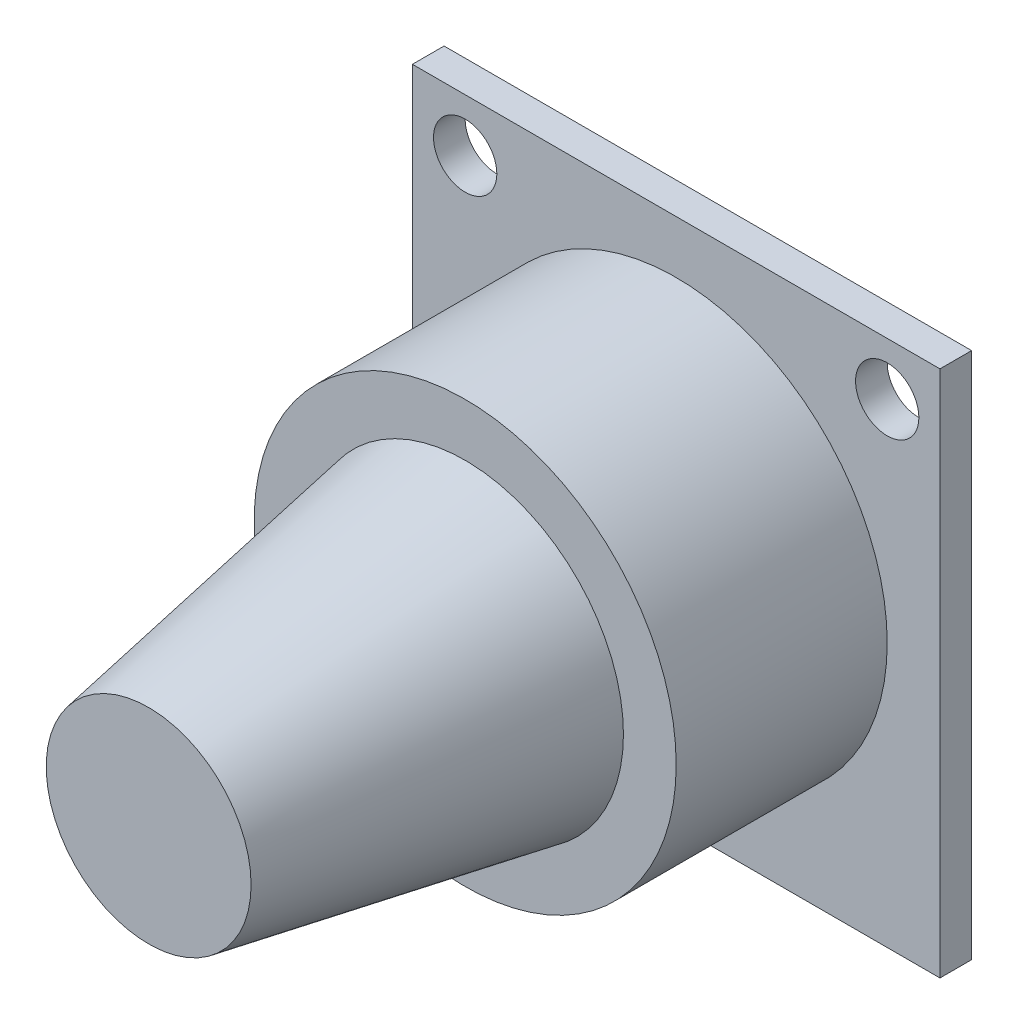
ISO-10303-21;
HEADER;
FILE_DESCRIPTION(('STEP AP214'),'2;1');
FILE_NAME('part.step','',(''),(''),'','','');
FILE_SCHEMA(('AUTOMOTIVE_DESIGN { 1 0 10303 214 1 1 1 1 }'));
ENDSEC;
DATA;
#1=APPLICATION_CONTEXT('core data for automotive mechanical design processes');
#2=APPLICATION_PROTOCOL_DEFINITION('international standard','automotive_design',2000,#1);
#3=PRODUCT_CONTEXT('',#1,'mechanical');
#4=PRODUCT('Part','Part','',(#3));
#5=PRODUCT_RELATED_PRODUCT_CATEGORY('part','',(#4));
#6=PRODUCT_DEFINITION_FORMATION('','',#4);
#7=PRODUCT_DEFINITION_CONTEXT('part definition',#1,'design');
#8=PRODUCT_DEFINITION('design','',#6,#7);
#9=PRODUCT_DEFINITION_SHAPE('','',#8);
#10=(LENGTH_UNIT() NAMED_UNIT(*) SI_UNIT(.MILLI.,.METRE.));
#11=(NAMED_UNIT(*) PLANE_ANGLE_UNIT() SI_UNIT($,.RADIAN.));
#12=(NAMED_UNIT(*) SI_UNIT($,.STERADIAN.) SOLID_ANGLE_UNIT());
#13=UNCERTAINTY_MEASURE_WITH_UNIT(LENGTH_MEASURE(1.E-05),#10,'distance_accuracy_value','');
#14=(GEOMETRIC_REPRESENTATION_CONTEXT(3) GLOBAL_UNCERTAINTY_ASSIGNED_CONTEXT((#13)) GLOBAL_UNIT_ASSIGNED_CONTEXT((#10,
#11,#12)) REPRESENTATION_CONTEXT('',''));
#15=CARTESIAN_POINT('',(0.,0.,0.));
#16=DIRECTION('',(0.,0.,1.));
#17=DIRECTION('',(1.,0.,0.));
#18=AXIS2_PLACEMENT_3D('',#15,#16,#17);
#19=CARTESIAN_POINT('',(25.,25.,3.));
#20=DIRECTION('',(-1.,0.,0.));
#21=DIRECTION('',(0.,-1.,0.));
#22=AXIS2_PLACEMENT_3D('',#19,#20,#21);
#23=PLANE('',#22);
#24=DIRECTION('',(0.,1.,0.));
#25=VECTOR('',#24,1.);
#26=CARTESIAN_POINT('',(25.,25.,0.));
#27=LINE('',#26,#25);
#28=CARTESIAN_POINT('',(25.,-25.,0.));
#29=VERTEX_POINT('',#28);
#30=CARTESIAN_POINT('',(25.,25.,0.));
#31=VERTEX_POINT('',#30);
#32=EDGE_CURVE('E101',#29,#31,#27,.T.);
#33=ORIENTED_EDGE('',*,*,#32,.T.);
#34=DIRECTION('',(0.,0.,-1.));
#35=VECTOR('',#34,1.);
#36=CARTESIAN_POINT('',(25.,25.,3.));
#37=LINE('',#36,#35);
#38=CARTESIAN_POINT('',(25.,25.,3.));
#39=VERTEX_POINT('',#38);
#40=EDGE_CURVE('E37',#39,#31,#37,.T.);
#41=ORIENTED_EDGE('',*,*,#40,.F.);
#42=DIRECTION('',(0.,1.,0.));
#43=VECTOR('',#42,1.);
#44=CARTESIAN_POINT('',(25.,25.,3.));
#45=LINE('',#44,#43);
#46=CARTESIAN_POINT('',(25.,-25.,3.));
#47=VERTEX_POINT('',#46);
#48=EDGE_CURVE('E88',#47,#39,#45,.T.);
#49=ORIENTED_EDGE('',*,*,#48,.F.);
#50=DIRECTION('',(0.,0.,-1.));
#51=VECTOR('',#50,1.);
#52=CARTESIAN_POINT('',(25.,-25.,3.));
#53=LINE('',#52,#51);
#54=EDGE_CURVE('E97',#47,#29,#53,.T.);
#55=ORIENTED_EDGE('',*,*,#54,.T.);
#56=EDGE_LOOP('',(#33,#41,#49,#55));
#57=FACE_BOUND('',#56,.T.);
#58=ADVANCED_FACE('F34',(#57),#23,.F.);
#59=CARTESIAN_POINT('',(-25.,25.,3.));
#60=DIRECTION('',(0.,-1.,0.));
#61=DIRECTION('',(0.,0.,-1.));
#62=AXIS2_PLACEMENT_3D('',#59,#60,#61);
#63=PLANE('',#62);
#64=DIRECTION('',(-1.,0.,0.));
#65=VECTOR('',#64,1.);
#66=CARTESIAN_POINT('',(-25.,25.,0.));
#67=LINE('',#66,#65);
#68=CARTESIAN_POINT('',(-25.,25.,0.));
#69=VERTEX_POINT('',#68);
#70=EDGE_CURVE('E93',#31,#69,#67,.T.);
#71=ORIENTED_EDGE('',*,*,#70,.T.);
#72=DIRECTION('',(0.,0.,-1.));
#73=VECTOR('',#72,1.);
#74=CARTESIAN_POINT('',(-25.,25.,3.));
#75=LINE('',#74,#73);
#76=CARTESIAN_POINT('',(-25.,25.,3.));
#77=VERTEX_POINT('',#76);
#78=EDGE_CURVE('E91',#77,#69,#75,.T.);
#79=ORIENTED_EDGE('',*,*,#78,.F.);
#80=DIRECTION('',(-1.,0.,0.));
#81=VECTOR('',#80,1.);
#82=CARTESIAN_POINT('',(-25.,25.,3.));
#83=LINE('',#82,#81);
#84=EDGE_CURVE('E83',#39,#77,#83,.T.);
#85=ORIENTED_EDGE('',*,*,#84,.F.);
#86=ORIENTED_EDGE('',*,*,#40,.T.);
#87=EDGE_LOOP('',(#71,#79,#85,#86));
#88=FACE_BOUND('',#87,.T.);
#89=ADVANCED_FACE('F92',(#88),#63,.F.);
#90=CARTESIAN_POINT('',(-25.,25.,3.));
#91=DIRECTION('',(1.,0.,0.));
#92=DIRECTION('',(0.,1.,0.));
#93=AXIS2_PLACEMENT_3D('',#90,#91,#92);
#94=PLANE('',#93);
#95=DIRECTION('',(0.,-1.,0.));
#96=VECTOR('',#95,1.);
#97=CARTESIAN_POINT('',(-25.,25.,0.));
#98=LINE('',#97,#96);
#99=CARTESIAN_POINT('',(-25.,-25.,0.));
#100=VERTEX_POINT('',#99);
#101=EDGE_CURVE('E69',#69,#100,#98,.T.);
#102=ORIENTED_EDGE('',*,*,#101,.T.);
#103=DIRECTION('',(0.,0.,-1.));
#104=VECTOR('',#103,1.);
#105=CARTESIAN_POINT('',(-25.,-25.,3.));
#106=LINE('',#105,#104);
#107=CARTESIAN_POINT('',(-25.,-25.,3.));
#108=VERTEX_POINT('',#107);
#109=EDGE_CURVE('E94',#108,#100,#106,.T.);
#110=ORIENTED_EDGE('',*,*,#109,.F.);
#111=DIRECTION('',(0.,-1.,0.));
#112=VECTOR('',#111,1.);
#113=CARTESIAN_POINT('',(-25.,25.,3.));
#114=LINE('',#113,#112);
#115=EDGE_CURVE('E86',#77,#108,#114,.T.);
#116=ORIENTED_EDGE('',*,*,#115,.F.);
#117=ORIENTED_EDGE('',*,*,#78,.T.);
#118=EDGE_LOOP('',(#102,#110,#116,#117));
#119=FACE_BOUND('',#118,.T.);
#120=ADVANCED_FACE('F95',(#119),#94,.F.);
#121=CARTESIAN_POINT('',(-25.,-25.,3.));
#122=DIRECTION('',(0.,1.,0.));
#123=DIRECTION('',(0.,0.,1.));
#124=AXIS2_PLACEMENT_3D('',#121,#122,#123);
#125=PLANE('',#124);
#126=DIRECTION('',(1.,0.,0.));
#127=VECTOR('',#126,1.);
#128=CARTESIAN_POINT('',(-25.,-25.,0.));
#129=LINE('',#128,#127);
#130=EDGE_CURVE('E75',#100,#29,#129,.T.);
#131=ORIENTED_EDGE('',*,*,#130,.T.);
#132=ORIENTED_EDGE('',*,*,#54,.F.);
#133=DIRECTION('',(1.,0.,0.));
#134=VECTOR('',#133,1.);
#135=CARTESIAN_POINT('',(-25.,-25.,3.));
#136=LINE('',#135,#134);
#137=EDGE_CURVE('E52',#108,#47,#136,.T.);
#138=ORIENTED_EDGE('',*,*,#137,.F.);
#139=ORIENTED_EDGE('',*,*,#109,.T.);
#140=EDGE_LOOP('',(#131,#132,#138,#139));
#141=FACE_BOUND('',#140,.T.);
#142=ADVANCED_FACE('F109',(#141),#125,.F.);
#143=CARTESIAN_POINT('',(0.,0.,3.));
#144=DIRECTION('',(0.,0.,1.));
#145=DIRECTION('',(1.,0.,0.));
#146=AXIS2_PLACEMENT_3D('',#143,#144,#145);
#147=PLANE('',#146);
#148=CARTESIAN_POINT('',(-20.,20.,3.));
#149=DIRECTION('',(0.,0.,1.));
#150=DIRECTION('',(1.,0.,0.));
#151=AXIS2_PLACEMENT_3D('',#148,#149,#150);
#152=CIRCLE('',#151,3.);
#153=CARTESIAN_POINT('',(-17.,20.,3.));
#154=VERTEX_POINT('',#153);
#155=EDGE_CURVE('E126',#154,#154,#152,.T.);
#156=ORIENTED_EDGE('',*,*,#155,.F.);
#157=EDGE_LOOP('',(#156));
#158=FACE_BOUND('',#157,.T.);
#159=CARTESIAN_POINT('',(20.,20.,3.));
#160=DIRECTION('',(0.,0.,1.));
#161=DIRECTION('',(1.,0.,0.));
#162=AXIS2_PLACEMENT_3D('',#159,#160,#161);
#163=CIRCLE('',#162,3.);
#164=CARTESIAN_POINT('',(23.,20.,3.));
#165=VERTEX_POINT('',#164);
#166=EDGE_CURVE('E127',#165,#165,#163,.T.);
#167=ORIENTED_EDGE('',*,*,#166,.F.);
#168=EDGE_LOOP('',(#167));
#169=FACE_BOUND('',#168,.T.);
#170=CARTESIAN_POINT('',(0.,0.,3.));
#171=DIRECTION('',(0.,0.,1.));
#172=DIRECTION('',(1.,0.,0.));
#173=AXIS2_PLACEMENT_3D('',#170,#171,#172);
#174=CIRCLE('',#173,20.);
#175=CARTESIAN_POINT('',(20.,0.,3.));
#176=VERTEX_POINT('',#175);
#177=EDGE_CURVE('E43',#176,#176,#174,.T.);
#178=ORIENTED_EDGE('',*,*,#177,.F.);
#179=EDGE_LOOP('',(#178));
#180=FACE_BOUND('',#179,.T.);
#181=ORIENTED_EDGE('',*,*,#48,.T.);
#182=ORIENTED_EDGE('',*,*,#84,.T.);
#183=ORIENTED_EDGE('',*,*,#115,.T.);
#184=ORIENTED_EDGE('',*,*,#137,.T.);
#185=EDGE_LOOP('',(#181,#182,#183,#184));
#186=FACE_BOUND('',#185,.T.);
#187=ADVANCED_FACE('F84',(#158,#169,#180,#186),#147,.T.);
#188=CARTESIAN_POINT('',(0.,0.,0.));
#189=DIRECTION('',(0.,0.,1.));
#190=DIRECTION('',(1.,0.,0.));
#191=AXIS2_PLACEMENT_3D('',#188,#189,#190);
#192=PLANE('',#191);
#193=CARTESIAN_POINT('',(0.,0.,0.));
#194=DIRECTION('',(0.,0.,-1.));
#195=DIRECTION('',(-1.,0.,0.));
#196=AXIS2_PLACEMENT_3D('',#193,#194,#195);
#197=CIRCLE('',#196,12.5);
#198=CARTESIAN_POINT('',(-12.5,0.,0.));
#199=VERTEX_POINT('',#198);
#200=EDGE_CURVE('E135',#199,#199,#197,.T.);
#201=ORIENTED_EDGE('',*,*,#200,.F.);
#202=EDGE_LOOP('',(#201));
#203=FACE_BOUND('',#202,.T.);
#204=CARTESIAN_POINT('',(-20.,20.,0.));
#205=DIRECTION('',(0.,0.,1.));
#206=DIRECTION('',(1.,0.,0.));
#207=AXIS2_PLACEMENT_3D('',#204,#205,#206);
#208=CIRCLE('',#207,3.);
#209=CARTESIAN_POINT('',(-17.,20.,0.));
#210=VERTEX_POINT('',#209);
#211=EDGE_CURVE('E121',#210,#210,#208,.F.);
#212=ORIENTED_EDGE('',*,*,#211,.F.);
#213=EDGE_LOOP('',(#212));
#214=FACE_BOUND('',#213,.T.);
#215=CARTESIAN_POINT('',(20.,20.,0.));
#216=DIRECTION('',(0.,0.,1.));
#217=DIRECTION('',(1.,0.,0.));
#218=AXIS2_PLACEMENT_3D('',#215,#216,#217);
#219=CIRCLE('',#218,3.);
#220=CARTESIAN_POINT('',(23.,20.,0.));
#221=VERTEX_POINT('',#220);
#222=EDGE_CURVE('E123',#221,#221,#219,.F.);
#223=ORIENTED_EDGE('',*,*,#222,.F.);
#224=EDGE_LOOP('',(#223));
#225=FACE_BOUND('',#224,.T.);
#226=ORIENTED_EDGE('',*,*,#32,.F.);
#227=ORIENTED_EDGE('',*,*,#130,.F.);
#228=ORIENTED_EDGE('',*,*,#101,.F.);
#229=ORIENTED_EDGE('',*,*,#70,.F.);
#230=EDGE_LOOP('',(#226,#227,#228,#229));
#231=FACE_BOUND('',#230,.T.);
#232=ADVANCED_FACE('F112',(#203,#214,#225,#231),#192,.F.);
#233=CARTESIAN_POINT('',(0.,0.,23.));
#234=DIRECTION('',(0.,0.,-1.));
#235=DIRECTION('',(-1.,0.,0.));
#236=AXIS2_PLACEMENT_3D('',#233,#234,#235);
#237=CYLINDRICAL_SURFACE('',#236,20.);
#238=CARTESIAN_POINT('',(0.,0.,23.));
#239=DIRECTION('',(0.,0.,1.));
#240=DIRECTION('',(1.,0.,0.));
#241=AXIS2_PLACEMENT_3D('',#238,#239,#240);
#242=CIRCLE('',#241,20.);
#243=CARTESIAN_POINT('',(20.,0.,23.));
#244=VERTEX_POINT('',#243);
#245=EDGE_CURVE('E104',#244,#244,#242,.T.);
#246=ORIENTED_EDGE('',*,*,#245,.F.);
#247=EDGE_LOOP('',(#246));
#248=FACE_BOUND('',#247,.T.);
#249=ORIENTED_EDGE('',*,*,#177,.T.);
#250=EDGE_LOOP('',(#249));
#251=FACE_BOUND('',#250,.T.);
#252=ADVANCED_FACE('F152',(#248,#251),#237,.T.);
#253=CARTESIAN_POINT('',(0.,0.,23.));
#254=DIRECTION('',(0.,0.,1.));
#255=DIRECTION('',(1.,0.,0.));
#256=AXIS2_PLACEMENT_3D('',#253,#254,#255);
#257=PLANE('',#256);
#258=CARTESIAN_POINT('',(0.,0.,23.));
#259=DIRECTION('',(0.,0.,1.));
#260=DIRECTION('',(1.,0.,0.));
#261=AXIS2_PLACEMENT_3D('',#258,#259,#260);
#262=CIRCLE('',#261,15.);
#263=CARTESIAN_POINT('',(15.,0.,23.));
#264=VERTEX_POINT('',#263);
#265=EDGE_CURVE('E11',#264,#264,#262,.T.);
#266=ORIENTED_EDGE('',*,*,#265,.F.);
#267=EDGE_LOOP('',(#266));
#268=FACE_BOUND('',#267,.T.);
#269=ORIENTED_EDGE('',*,*,#245,.T.);
#270=EDGE_LOOP('',(#269));
#271=FACE_BOUND('',#270,.T.);
#272=ADVANCED_FACE('F188',(#268,#271),#257,.T.);
#273=CARTESIAN_POINT('',(0.,0.,23.));
#274=DIRECTION('',(0.,0.,-1.));
#275=DIRECTION('',(1.,0.,0.));
#276=AXIS2_PLACEMENT_3D('',#273,#274,#275);
#277=CONICAL_SURFACE('',#276,15.,0.174532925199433);
#278=CARTESIAN_POINT('',(0.,0.,53.));
#279=DIRECTION('',(0.,0.,1.));
#280=DIRECTION('',(1.,0.,0.));
#281=AXIS2_PLACEMENT_3D('',#278,#279,#280);
#282=CIRCLE('',#281,9.71019057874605);
#283=CARTESIAN_POINT('',(9.71019057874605,0.,53.));
#284=VERTEX_POINT('',#283);
#285=EDGE_CURVE('E119',#284,#284,#282,.T.);
#286=ORIENTED_EDGE('',*,*,#285,.F.);
#287=EDGE_LOOP('',(#286));
#288=FACE_BOUND('',#287,.T.);
#289=ORIENTED_EDGE('',*,*,#265,.T.);
#290=EDGE_LOOP('',(#289));
#291=FACE_BOUND('',#290,.T.);
#292=ADVANCED_FACE('F169',(#288,#291),#277,.T.);
#293=CARTESIAN_POINT('',(0.,0.,53.));
#294=DIRECTION('',(0.,0.,1.));
#295=DIRECTION('',(1.,0.,0.));
#296=AXIS2_PLACEMENT_3D('',#293,#294,#295);
#297=PLANE('',#296);
#298=ORIENTED_EDGE('',*,*,#285,.T.);
#299=EDGE_LOOP('',(#298));
#300=FACE_BOUND('',#299,.T.);
#301=ADVANCED_FACE('F160',(#300),#297,.T.);
#302=CARTESIAN_POINT('',(20.,20.,-0.00100000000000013));
#303=DIRECTION('',(0.,0.,1.));
#304=DIRECTION('',(1.,0.,0.));
#305=AXIS2_PLACEMENT_3D('',#302,#303,#304);
#306=CYLINDRICAL_SURFACE('',#305,3.);
#307=CARTESIAN_POINT('',(23.,20.,3.));
#308=CARTESIAN_POINT('',(23.,20.,2.96875));
#309=CARTESIAN_POINT('',(23.,20.,2.9375));
#310=CARTESIAN_POINT('',(23.,20.,2.875));
#311=CARTESIAN_POINT('',(23.,20.,2.84375));
#312=CARTESIAN_POINT('',(23.,20.,2.78125));
#313=CARTESIAN_POINT('',(23.,20.,2.75));
#314=CARTESIAN_POINT('',(23.,20.,2.6875));
#315=CARTESIAN_POINT('',(23.,20.,2.65625));
#316=CARTESIAN_POINT('',(23.,20.,2.59375));
#317=CARTESIAN_POINT('',(23.,20.,2.5625));
#318=CARTESIAN_POINT('',(23.,20.,2.5));
#319=CARTESIAN_POINT('',(23.,20.,2.46875));
#320=CARTESIAN_POINT('',(23.,20.,2.40625));
#321=CARTESIAN_POINT('',(23.,20.,2.375));
#322=CARTESIAN_POINT('',(23.,20.,2.3125));
#323=CARTESIAN_POINT('',(23.,20.,2.28125));
#324=CARTESIAN_POINT('',(23.,20.,2.21875));
#325=CARTESIAN_POINT('',(23.,20.,2.1875));
#326=CARTESIAN_POINT('',(23.,20.,2.125));
#327=CARTESIAN_POINT('',(23.,20.,2.09375));
#328=CARTESIAN_POINT('',(23.,20.,2.03125));
#329=CARTESIAN_POINT('',(23.,20.,2.));
#330=CARTESIAN_POINT('',(23.,20.,1.9375));
#331=CARTESIAN_POINT('',(23.,20.,1.90625));
#332=CARTESIAN_POINT('',(23.,20.,1.84375));
#333=CARTESIAN_POINT('',(23.,20.,1.8125));
#334=CARTESIAN_POINT('',(23.,20.,1.75));
#335=CARTESIAN_POINT('',(23.,20.,1.71875));
#336=CARTESIAN_POINT('',(23.,20.,1.65625));
#337=CARTESIAN_POINT('',(23.,20.,1.625));
#338=CARTESIAN_POINT('',(23.,20.,1.5625));
#339=CARTESIAN_POINT('',(23.,20.,1.53125));
#340=CARTESIAN_POINT('',(23.,20.,1.46875));
#341=CARTESIAN_POINT('',(23.,20.,1.4375));
#342=CARTESIAN_POINT('',(23.,20.,1.375));
#343=CARTESIAN_POINT('',(23.,20.,1.34375));
#344=CARTESIAN_POINT('',(23.,20.,1.28125));
#345=CARTESIAN_POINT('',(23.,20.,1.25));
#346=CARTESIAN_POINT('',(23.,20.,1.1875));
#347=CARTESIAN_POINT('',(23.,20.,1.15625));
#348=CARTESIAN_POINT('',(23.,20.,1.09375));
#349=CARTESIAN_POINT('',(23.,20.,1.0625));
#350=CARTESIAN_POINT('',(23.,20.,1.));
#351=CARTESIAN_POINT('',(23.,20.,0.96875));
#352=CARTESIAN_POINT('',(23.,20.,0.90625));
#353=CARTESIAN_POINT('',(23.,20.,0.875));
#354=CARTESIAN_POINT('',(23.,20.,0.8125));
#355=CARTESIAN_POINT('',(23.,20.,0.78125));
#356=CARTESIAN_POINT('',(23.,20.,0.71875));
#357=CARTESIAN_POINT('',(23.,20.,0.6875));
#358=CARTESIAN_POINT('',(23.,20.,0.625));
#359=CARTESIAN_POINT('',(23.,20.,0.59375));
#360=CARTESIAN_POINT('',(23.,20.,0.53125));
#361=CARTESIAN_POINT('',(23.,20.,0.5));
#362=CARTESIAN_POINT('',(23.,20.,0.4375));
#363=CARTESIAN_POINT('',(23.,20.,0.40625));
#364=CARTESIAN_POINT('',(23.,20.,0.34375));
#365=CARTESIAN_POINT('',(23.,20.,0.3125));
#366=CARTESIAN_POINT('',(23.,20.,0.25));
#367=CARTESIAN_POINT('',(23.,20.,0.21875));
#368=CARTESIAN_POINT('',(23.,20.,0.15625));
#369=CARTESIAN_POINT('',(23.,20.,0.125));
#370=CARTESIAN_POINT('',(23.,20.,0.0625000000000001));
#371=CARTESIAN_POINT('',(23.,20.,0.0312500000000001));
#372=CARTESIAN_POINT('',(23.,20.,0.));
#373=B_SPLINE_CURVE_WITH_KNOTS('',3,(#307,#308,#309,#310,#311,#312,#313,#314,#315,#316,#317,
#318,#319,#320,#321,#322,#323,#324,#325,#326,#327,#328,#329,#330,#331,#332,#333,#334,#335,#336,
#337,#338,#339,#340,#341,#342,#343,#344,#345,#346,#347,#348,#349,#350,#351,#352,#353,#354,#355,
#356,#357,#358,#359,#360,#361,#362,#363,#364,#365,#366,#367,#368,#369,#370,#371,#372),
.UNSPECIFIED.,.F.,.F.,(4,2,2,2,2,2,2,2,2,2,2,2,2,2,2,2,2,2,2,2,2,2,2,2,2,2,2,2,2,2,2,2,4),(0.,
0.0937500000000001,0.1875,0.28125,0.375,0.46875,0.5625,0.65625,0.75,0.84375,0.9375,1.03125,
1.125,1.21875,1.3125,1.40625,1.5,1.59375,1.6875,1.78125,1.875,1.96875,2.0625,2.15625,2.25,
2.34375,2.4375,2.53125,2.625,2.71875,2.8125,2.90625,3.),.UNSPECIFIED.);
#374=EDGE_CURVE('BSEAM158',#165,#221,#373,.T.);
#375=ORIENTED_EDGE('',*,*,#166,.T.);
#376=ORIENTED_EDGE('',*,*,#222,.T.);
#377=ORIENTED_EDGE('',*,*,#374,.T.);
#378=ORIENTED_EDGE('',*,*,#374,.F.);
#379=EDGE_LOOP('',(#375,#377,#376,#378));
#380=FACE_BOUND('',#379,.T.);
#381=ADVANCED_FACE('F158',(#380),#306,.F.);
#382=CARTESIAN_POINT('',(-20.,20.,-0.00100000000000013));
#383=DIRECTION('',(0.,0.,1.));
#384=DIRECTION('',(1.,0.,0.));
#385=AXIS2_PLACEMENT_3D('',#382,#383,#384);
#386=CYLINDRICAL_SURFACE('',#385,3.);
#387=CARTESIAN_POINT('',(-17.,20.,3.));
#388=CARTESIAN_POINT('',(-17.,20.,2.96875));
#389=CARTESIAN_POINT('',(-17.,20.,2.9375));
#390=CARTESIAN_POINT('',(-17.,20.,2.875));
#391=CARTESIAN_POINT('',(-17.,20.,2.84375));
#392=CARTESIAN_POINT('',(-17.,20.,2.78125));
#393=CARTESIAN_POINT('',(-17.,20.,2.75));
#394=CARTESIAN_POINT('',(-17.,20.,2.6875));
#395=CARTESIAN_POINT('',(-17.,20.,2.65625));
#396=CARTESIAN_POINT('',(-17.,20.,2.59375));
#397=CARTESIAN_POINT('',(-17.,20.,2.5625));
#398=CARTESIAN_POINT('',(-17.,20.,2.5));
#399=CARTESIAN_POINT('',(-17.,20.,2.46875));
#400=CARTESIAN_POINT('',(-17.,20.,2.40625));
#401=CARTESIAN_POINT('',(-17.,20.,2.375));
#402=CARTESIAN_POINT('',(-17.,20.,2.3125));
#403=CARTESIAN_POINT('',(-17.,20.,2.28125));
#404=CARTESIAN_POINT('',(-17.,20.,2.21875));
#405=CARTESIAN_POINT('',(-17.,20.,2.1875));
#406=CARTESIAN_POINT('',(-17.,20.,2.125));
#407=CARTESIAN_POINT('',(-17.,20.,2.09375));
#408=CARTESIAN_POINT('',(-17.,20.,2.03125));
#409=CARTESIAN_POINT('',(-17.,20.,2.));
#410=CARTESIAN_POINT('',(-17.,20.,1.9375));
#411=CARTESIAN_POINT('',(-17.,20.,1.90625));
#412=CARTESIAN_POINT('',(-17.,20.,1.84375));
#413=CARTESIAN_POINT('',(-17.,20.,1.8125));
#414=CARTESIAN_POINT('',(-17.,20.,1.75));
#415=CARTESIAN_POINT('',(-17.,20.,1.71875));
#416=CARTESIAN_POINT('',(-17.,20.,1.65625));
#417=CARTESIAN_POINT('',(-17.,20.,1.625));
#418=CARTESIAN_POINT('',(-17.,20.,1.5625));
#419=CARTESIAN_POINT('',(-17.,20.,1.53125));
#420=CARTESIAN_POINT('',(-17.,20.,1.46875));
#421=CARTESIAN_POINT('',(-17.,20.,1.4375));
#422=CARTESIAN_POINT('',(-17.,20.,1.375));
#423=CARTESIAN_POINT('',(-17.,20.,1.34375));
#424=CARTESIAN_POINT('',(-17.,20.,1.28125));
#425=CARTESIAN_POINT('',(-17.,20.,1.25));
#426=CARTESIAN_POINT('',(-17.,20.,1.1875));
#427=CARTESIAN_POINT('',(-17.,20.,1.15625));
#428=CARTESIAN_POINT('',(-17.,20.,1.09375));
#429=CARTESIAN_POINT('',(-17.,20.,1.0625));
#430=CARTESIAN_POINT('',(-17.,20.,1.));
#431=CARTESIAN_POINT('',(-17.,20.,0.96875));
#432=CARTESIAN_POINT('',(-17.,20.,0.90625));
#433=CARTESIAN_POINT('',(-17.,20.,0.875));
#434=CARTESIAN_POINT('',(-17.,20.,0.8125));
#435=CARTESIAN_POINT('',(-17.,20.,0.78125));
#436=CARTESIAN_POINT('',(-17.,20.,0.71875));
#437=CARTESIAN_POINT('',(-17.,20.,0.6875));
#438=CARTESIAN_POINT('',(-17.,20.,0.625));
#439=CARTESIAN_POINT('',(-17.,20.,0.59375));
#440=CARTESIAN_POINT('',(-17.,20.,0.53125));
#441=CARTESIAN_POINT('',(-17.,20.,0.5));
#442=CARTESIAN_POINT('',(-17.,20.,0.4375));
#443=CARTESIAN_POINT('',(-17.,20.,0.40625));
#444=CARTESIAN_POINT('',(-17.,20.,0.34375));
#445=CARTESIAN_POINT('',(-17.,20.,0.3125));
#446=CARTESIAN_POINT('',(-17.,20.,0.25));
#447=CARTESIAN_POINT('',(-17.,20.,0.21875));
#448=CARTESIAN_POINT('',(-17.,20.,0.15625));
#449=CARTESIAN_POINT('',(-17.,20.,0.125));
#450=CARTESIAN_POINT('',(-17.,20.,0.0625000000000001));
#451=CARTESIAN_POINT('',(-17.,20.,0.0312500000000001));
#452=CARTESIAN_POINT('',(-17.,20.,0.));
#453=B_SPLINE_CURVE_WITH_KNOTS('',3,(#387,#388,#389,#390,#391,#392,#393,#394,#395,#396,#397,
#398,#399,#400,#401,#402,#403,#404,#405,#406,#407,#408,#409,#410,#411,#412,#413,#414,#415,#416,
#417,#418,#419,#420,#421,#422,#423,#424,#425,#426,#427,#428,#429,#430,#431,#432,#433,#434,#435,
#436,#437,#438,#439,#440,#441,#442,#443,#444,#445,#446,#447,#448,#449,#450,#451,#452),
.UNSPECIFIED.,.F.,.F.,(4,2,2,2,2,2,2,2,2,2,2,2,2,2,2,2,2,2,2,2,2,2,2,2,2,2,2,2,2,2,2,2,4),(0.,
0.0937500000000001,0.1875,0.28125,0.375,0.46875,0.5625,0.65625,0.75,0.84375,0.9375,1.03125,
1.125,1.21875,1.3125,1.40625,1.5,1.59375,1.6875,1.78125,1.875,1.96875,2.0625,2.15625,2.25,
2.34375,2.4375,2.53125,2.625,2.71875,2.8125,2.90625,3.),.UNSPECIFIED.);
#454=EDGE_CURVE('BSEAM146',#154,#210,#453,.T.);
#455=ORIENTED_EDGE('',*,*,#155,.T.);
#456=ORIENTED_EDGE('',*,*,#211,.T.);
#457=ORIENTED_EDGE('',*,*,#454,.T.);
#458=ORIENTED_EDGE('',*,*,#454,.F.);
#459=EDGE_LOOP('',(#455,#457,#456,#458));
#460=FACE_BOUND('',#459,.T.);
#461=ADVANCED_FACE('F146',(#460),#386,.F.);
#462=CARTESIAN_POINT('',(0.,0.,10.));
#463=DIRECTION('',(0.,0.,-1.));
#464=DIRECTION('',(-1.,0.,0.));
#465=AXIS2_PLACEMENT_3D('',#462,#463,#464);
#466=CYLINDRICAL_SURFACE('',#465,12.5);
#467=CARTESIAN_POINT('',(0.,0.,10.));
#468=DIRECTION('',(0.,0.,-1.));
#469=DIRECTION('',(-1.,0.,0.));
#470=AXIS2_PLACEMENT_3D('',#467,#468,#469);
#471=CIRCLE('',#470,12.5);
#472=CARTESIAN_POINT('',(-12.5,0.,10.));
#473=VERTEX_POINT('',#472);
#474=EDGE_CURVE('E130',#473,#473,#471,.T.);
#475=ORIENTED_EDGE('',*,*,#474,.F.);
#476=EDGE_LOOP('',(#475));
#477=FACE_BOUND('',#476,.T.);
#478=ORIENTED_EDGE('',*,*,#200,.T.);
#479=EDGE_LOOP('',(#478));
#480=FACE_BOUND('',#479,.T.);
#481=ADVANCED_FACE('F143',(#477,#480),#466,.F.);
#482=CARTESIAN_POINT('',(0.,10.,10.));
#483=DIRECTION('',(0.,0.,-1.));
#484=DIRECTION('',(-1.,0.,0.));
#485=AXIS2_PLACEMENT_3D('',#482,#483,#484);
#486=PLANE('',#485);
#487=ORIENTED_EDGE('',*,*,#474,.T.);
#488=EDGE_LOOP('',(#487));
#489=FACE_BOUND('',#488,.T.);
#490=ADVANCED_FACE('F141',(#489),#486,.T.);
#491=CLOSED_SHELL('',(#58,#89,#120,#142,#187,#232,#252,#272,#292,#301,#381,#461,#481,#490));
#492=MANIFOLD_SOLID_BREP('B2',#491);
#493=ADVANCED_BREP_SHAPE_REPRESENTATION('',(#18,#492),#14);
#494=SHAPE_DEFINITION_REPRESENTATION(#9,#493);
ENDSEC;
END-ISO-10303-21;
